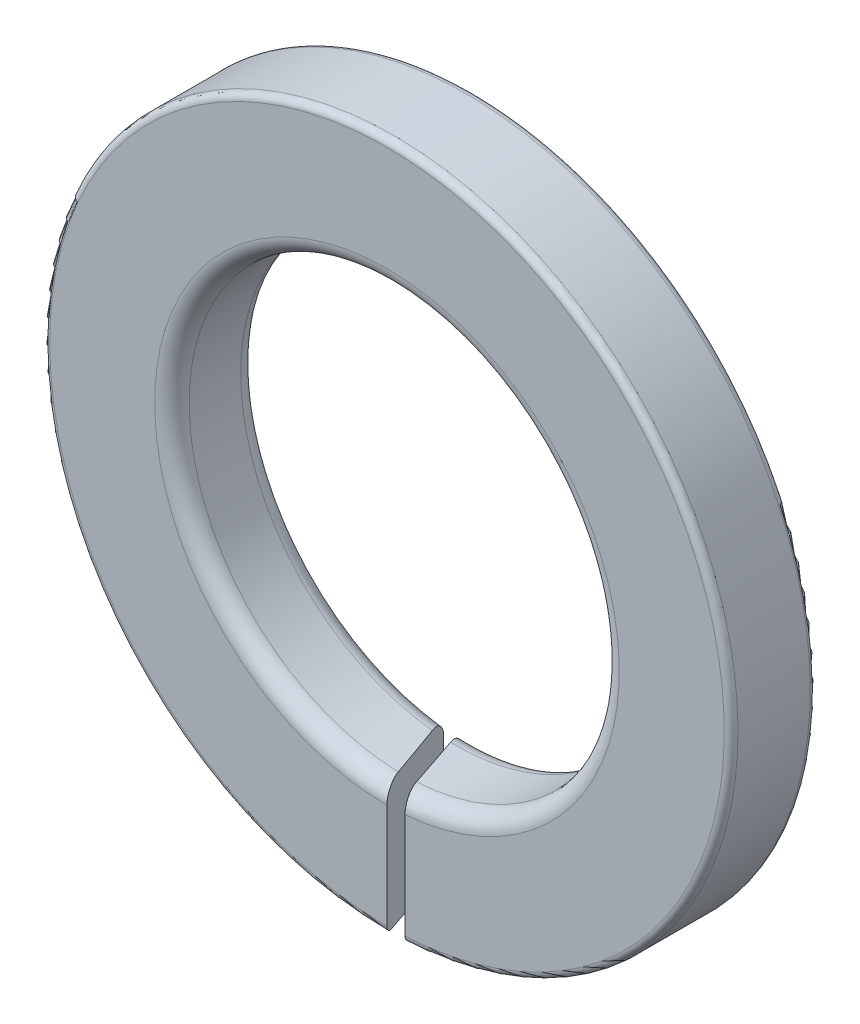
ISO-10303-21;
HEADER;
FILE_DESCRIPTION(('STEP AP214'),'2;1');
FILE_NAME('part.step','',(''),(''),'','','');
FILE_SCHEMA(('AUTOMOTIVE_DESIGN { 1 0 10303 214 1 1 1 1 }'));
ENDSEC;
DATA;
#1=APPLICATION_CONTEXT('core data for automotive mechanical design processes');
#2=APPLICATION_PROTOCOL_DEFINITION('international standard','automotive_design',2000,#1);
#3=PRODUCT_CONTEXT('',#1,'mechanical');
#4=PRODUCT('Part','Part','',(#3));
#5=PRODUCT_RELATED_PRODUCT_CATEGORY('part','',(#4));
#6=PRODUCT_DEFINITION_FORMATION('','',#4);
#7=PRODUCT_DEFINITION_CONTEXT('part definition',#1,'design');
#8=PRODUCT_DEFINITION('design','',#6,#7);
#9=PRODUCT_DEFINITION_SHAPE('','',#8);
#10=(LENGTH_UNIT() NAMED_UNIT(*) SI_UNIT(.MILLI.,.METRE.));
#11=(NAMED_UNIT(*) PLANE_ANGLE_UNIT() SI_UNIT($,.RADIAN.));
#12=(NAMED_UNIT(*) SI_UNIT($,.STERADIAN.) SOLID_ANGLE_UNIT());
#13=UNCERTAINTY_MEASURE_WITH_UNIT(LENGTH_MEASURE(1.E-05),#10,'distance_accuracy_value','');
#14=(GEOMETRIC_REPRESENTATION_CONTEXT(3) GLOBAL_UNCERTAINTY_ASSIGNED_CONTEXT((#13)) GLOBAL_UNIT_ASSIGNED_CONTEXT((#10,
#11,#12)) REPRESENTATION_CONTEXT('',''));
#15=CARTESIAN_POINT('',(0.,0.,0.));
#16=DIRECTION('',(0.,0.,1.));
#17=DIRECTION('',(1.,0.,0.));
#18=AXIS2_PLACEMENT_3D('',#15,#16,#17);
#19=CARTESIAN_POINT('',(0.,0.,2.5));
#20=DIRECTION('',(0.,0.,1.));
#21=DIRECTION('',(1.,0.,0.));
#22=AXIS2_PLACEMENT_3D('',#19,#20,#21);
#23=PLANE('',#22);
#24=DIRECTION('',(0.,1.,0.));
#25=VECTOR('',#24,1.);
#26=CARTESIAN_POINT('',(0.524617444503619,-10.,2.5));
#27=LINE('',#26,#25);
#28=CARTESIAN_POINT('',(0.524617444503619,-9.78594791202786,2.5));
#29=VERTEX_POINT('',#28);
#30=CARTESIAN_POINT('',(0.524617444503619,-6.72958219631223,2.5));
#31=VERTEX_POINT('',#30);
#32=EDGE_CURVE('E107',#29,#31,#27,.T.);
#33=ORIENTED_EDGE('',*,*,#32,.F.);
#34=CARTESIAN_POINT('',(0.,0.,2.5));
#35=DIRECTION('',(0.,0.,1.));
#36=DIRECTION('',(1.,0.,0.));
#37=AXIS2_PLACEMENT_3D('',#34,#35,#36);
#38=CIRCLE('',#37,9.8);
#39=CARTESIAN_POINT('',(0.,-9.8,2.5));
#40=VERTEX_POINT('',#39);
#41=EDGE_CURVE('E166',#29,#40,#38,.T.);
#42=ORIENTED_EDGE('',*,*,#41,.T.);
#43=DIRECTION('',(0.,1.,0.));
#44=VECTOR('',#43,1.);
#45=CARTESIAN_POINT('',(0.,-10.,2.5));
#46=LINE('',#45,#44);
#47=CARTESIAN_POINT('',(0.,-6.75,2.5));
#48=VERTEX_POINT('',#47);
#49=EDGE_CURVE('E198',#40,#48,#46,.T.);
#50=ORIENTED_EDGE('',*,*,#49,.T.);
#51=CARTESIAN_POINT('',(0.,0.,2.5));
#52=DIRECTION('',(0.,0.,1.));
#53=DIRECTION('',(1.,0.,0.));
#54=AXIS2_PLACEMENT_3D('',#51,#52,#53);
#55=CIRCLE('',#54,6.75);
#56=EDGE_CURVE('E196',#48,#31,#55,.F.);
#57=ORIENTED_EDGE('',*,*,#56,.T.);
#58=EDGE_LOOP('',(#33,#42,#50,#57));
#59=FACE_BOUND('',#58,.T.);
#60=ADVANCED_FACE('F36',(#59),#23,.T.);
#61=CARTESIAN_POINT('',(0.,0.,0.));
#62=DIRECTION('',(0.,0.,1.));
#63=DIRECTION('',(1.,0.,0.));
#64=AXIS2_PLACEMENT_3D('',#61,#62,#63);
#65=PLANE('',#64);
#66=DIRECTION('',(0.,1.,0.));
#67=VECTOR('',#66,1.);
#68=CARTESIAN_POINT('',(-0.851663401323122,-10.,0.));
#69=LINE('',#68,#67);
#70=CARTESIAN_POINT('',(-0.851663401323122,-9.76292320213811,0.));
#71=VERTEX_POINT('',#70);
#72=CARTESIAN_POINT('',(-0.851663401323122,-6.69605626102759,0.));
#73=VERTEX_POINT('',#72);
#74=EDGE_CURVE('E226',#71,#73,#69,.T.);
#75=ORIENTED_EDGE('',*,*,#74,.F.);
#76=CARTESIAN_POINT('',(0.,0.,0.));
#77=DIRECTION('',(0.,0.,1.));
#78=DIRECTION('',(1.,0.,0.));
#79=AXIS2_PLACEMENT_3D('',#76,#77,#78);
#80=CIRCLE('',#79,9.8);
#81=CARTESIAN_POINT('',(-0.327045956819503,-9.79454138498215,0.));
#82=VERTEX_POINT('',#81);
#83=EDGE_CURVE('E11',#71,#82,#80,.F.);
#84=ORIENTED_EDGE('',*,*,#83,.T.);
#85=DIRECTION('',(0.,1.,0.));
#86=VECTOR('',#85,1.);
#87=CARTESIAN_POINT('',(-0.327045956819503,-10.,0.));
#88=LINE('',#87,#86);
#89=CARTESIAN_POINT('',(-0.327045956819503,-6.74207245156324,0.));
#90=VERTEX_POINT('',#89);
#91=EDGE_CURVE('E197',#82,#90,#88,.T.);
#92=ORIENTED_EDGE('',*,*,#91,.T.);
#93=CARTESIAN_POINT('',(0.,0.,0.));
#94=DIRECTION('',(0.,0.,1.));
#95=DIRECTION('',(1.,0.,0.));
#96=AXIS2_PLACEMENT_3D('',#93,#94,#95);
#97=CIRCLE('',#96,6.75);
#98=EDGE_CURVE('E112',#90,#73,#97,.T.);
#99=ORIENTED_EDGE('',*,*,#98,.T.);
#100=EDGE_LOOP('',(#75,#84,#92,#99));
#101=FACE_BOUND('',#100,.T.);
#102=ADVANCED_FACE('F218',(#101),#65,.F.);
#103=CARTESIAN_POINT('',(0.,0.,2.5));
#104=DIRECTION('',(0.,0.,-1.));
#105=DIRECTION('',(-1.,0.,0.));
#106=AXIS2_PLACEMENT_3D('',#103,#104,#105);
#107=CYLINDRICAL_SURFACE('',#106,10.);
#108=CARTESIAN_POINT('',(0.,0.,2.5));
#109=DIRECTION('',(-0.946580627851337,0.,0.322467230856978));
#110=DIRECTION('',(-0.322467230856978,0.,-0.946580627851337));
#111=AXIS2_PLACEMENT_3D('',#108,#109,#110);
#112=ELLIPSE('',#111,31.0109029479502,10.);
#113=CARTESIAN_POINT('',(-0.783530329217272,-9.96925675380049,0.2));
#114=VERTEX_POINT('',#113);
#115=CARTESIAN_POINT('',(-0.06813307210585,-9.99976789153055,2.3));
#116=VERTEX_POINT('',#115);
#117=EDGE_CURVE('E234',#114,#116,#112,.T.);
#118=ORIENTED_EDGE('',*,*,#117,.T.);
#119=CARTESIAN_POINT('',(0.,0.,2.3));
#120=DIRECTION('',(0.,0.,1.));
#121=DIRECTION('',(1.,0.,0.));
#122=AXIS2_PLACEMENT_3D('',#119,#120,#121);
#123=CIRCLE('',#122,10.);
#124=CARTESIAN_POINT('',(0.456484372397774,-9.98957566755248,2.30000000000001));
#125=VERTEX_POINT('',#124);
#126=EDGE_CURVE('E184',#116,#125,#123,.F.);
#127=ORIENTED_EDGE('',*,*,#126,.T.);
#128=CARTESIAN_POINT('',(0.,0.,0.960021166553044));
#129=DIRECTION('',(0.946580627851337,0.,-0.322467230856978));
#130=DIRECTION('',(-0.322467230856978,0.,-0.946580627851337));
#131=AXIS2_PLACEMENT_3D('',#128,#129,#130);
#132=ELLIPSE('',#131,31.0109029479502,10.);
#133=CARTESIAN_POINT('',(-0.258912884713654,-9.99664764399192,0.199999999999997));
#134=VERTEX_POINT('',#133);
#135=EDGE_CURVE('E189',#125,#134,#132,.T.);
#136=ORIENTED_EDGE('',*,*,#135,.T.);
#137=CARTESIAN_POINT('',(0.,0.,0.2));
#138=DIRECTION('',(0.,0.,1.));
#139=DIRECTION('',(1.,0.,0.));
#140=AXIS2_PLACEMENT_3D('',#137,#138,#139);
#141=CIRCLE('',#140,10.);
#142=EDGE_CURVE('E231',#134,#114,#141,.T.);
#143=ORIENTED_EDGE('',*,*,#142,.T.);
#144=EDGE_LOOP('',(#118,#127,#136,#143));
#145=FACE_BOUND('',#144,.T.);
#146=ADVANCED_FACE('F38',(#145),#107,.T.);
#147=CARTESIAN_POINT('',(0.,0.,2.5));
#148=DIRECTION('',(0.,0.,-1.));
#149=DIRECTION('',(-1.,0.,0.));
#150=AXIS2_PLACEMENT_3D('',#147,#148,#149);
#151=CYLINDRICAL_SURFACE('',#150,6.25);
#152=CARTESIAN_POINT('',(0.,0.,0.960021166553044));
#153=DIRECTION('',(0.946580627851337,0.,-0.322467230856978));
#154=DIRECTION('',(-0.322467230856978,0.,-0.946580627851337));
#155=AXIS2_PLACEMENT_3D('',#152,#153,#154);
#156=ELLIPSE('',#155,19.3818143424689,6.25);
#157=CARTESIAN_POINT('',(0.354284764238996,-6.2399505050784,2.));
#158=VERTEX_POINT('',#157);
#159=CARTESIAN_POINT('',(-0.156713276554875,-6.24803496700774,0.50000000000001));
#160=VERTEX_POINT('',#159);
#161=EDGE_CURVE('E104',#158,#160,#156,.T.);
#162=ORIENTED_EDGE('',*,*,#161,.F.);
#163=CARTESIAN_POINT('',(0.,0.,2.));
#164=DIRECTION('',(0.,0.,1.));
#165=DIRECTION('',(1.,0.,0.));
#166=AXIS2_PLACEMENT_3D('',#163,#164,#165);
#167=CIRCLE('',#166,6.25);
#168=CARTESIAN_POINT('',(-0.170332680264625,-6.24767851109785,2.));
#169=VERTEX_POINT('',#168);
#170=EDGE_CURVE('E119',#158,#169,#167,.T.);
#171=ORIENTED_EDGE('',*,*,#170,.T.);
#172=CARTESIAN_POINT('',(0.,0.,2.5));
#173=DIRECTION('',(-0.946580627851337,0.,0.322467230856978));
#174=DIRECTION('',(-0.322467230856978,0.,-0.946580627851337));
#175=AXIS2_PLACEMENT_3D('',#172,#173,#174);
#176=ELLIPSE('',#175,19.3818143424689,6.25);
#177=CARTESIAN_POINT('',(-0.681330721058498,-6.21275208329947,0.499999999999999));
#178=VERTEX_POINT('',#177);
#179=EDGE_CURVE('E123',#178,#169,#176,.T.);
#180=ORIENTED_EDGE('',*,*,#179,.F.);
#181=CARTESIAN_POINT('',(0.,0.,0.5));
#182=DIRECTION('',(0.,0.,1.));
#183=DIRECTION('',(1.,0.,0.));
#184=AXIS2_PLACEMENT_3D('',#181,#182,#183);
#185=CIRCLE('',#184,6.25);
#186=EDGE_CURVE('E122',#178,#160,#185,.F.);
#187=ORIENTED_EDGE('',*,*,#186,.T.);
#188=EDGE_LOOP('',(#162,#171,#180,#187));
#189=FACE_BOUND('',#188,.T.);
#190=ADVANCED_FACE('F117',(#189),#151,.F.);
#191=CARTESIAN_POINT('',(-0.851663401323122,-10.,0.));
#192=DIRECTION('',(-0.946580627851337,0.,0.322467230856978));
#193=DIRECTION('',(0.322467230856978,0.,0.946580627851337));
#194=AXIS2_PLACEMENT_3D('',#191,#192,#193);
#195=PLANE('',#194);
#196=ORIENTED_EDGE('',*,*,#49,.F.);
#197=CARTESIAN_POINT('',(0.,-9.8,2.5));
#198=CARTESIAN_POINT('',(3.84756068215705E-06,-9.81081676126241,2.50001129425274));
#199=CARTESIAN_POINT('',(-0.000298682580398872,-9.82162719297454,2.49912323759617));
#200=CARTESIAN_POINT('',(-0.0014867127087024,-9.84291158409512,2.49563585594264));
#201=CARTESIAN_POINT('',(-0.00237090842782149,-9.85338624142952,2.493040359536));
#202=CARTESIAN_POINT('',(-0.00469267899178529,-9.87372589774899,2.4862249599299));
#203=CARTESIAN_POINT('',(-0.00613023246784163,-9.883590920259,2.48200511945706));
#204=CARTESIAN_POINT('',(-0.0095075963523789,-9.90245630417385,2.47209109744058));
#205=CARTESIAN_POINT('',(-0.0114475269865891,-9.91145645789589,2.4663965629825));
#206=CARTESIAN_POINT('',(-0.015815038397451,-9.9285614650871,2.45357603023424));
#207=CARTESIAN_POINT('',(-0.0182524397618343,-9.9366421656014,2.4464212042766));
#208=CARTESIAN_POINT('',(-0.023511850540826,-9.95149300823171,2.4309825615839));
#209=CARTESIAN_POINT('',(-0.0263339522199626,-9.95826283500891,2.42269847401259));
#210=CARTESIAN_POINT('',(-0.0324303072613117,-9.97065407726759,2.40480303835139));
#211=CARTESIAN_POINT('',(-0.035719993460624,-9.97620241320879,2.39514638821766));
#212=CARTESIAN_POINT('',(-0.0425433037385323,-9.98559771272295,2.37511702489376));
#213=CARTESIAN_POINT('',(-0.046076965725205,-9.98944441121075,2.36474420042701));
#214=CARTESIAN_POINT('',(-0.0526929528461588,-9.99487420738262,2.34532342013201));
#215=CARTESIAN_POINT('',(-0.0557526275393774,-9.99672733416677,2.33634195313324));
#216=CARTESIAN_POINT('',(-0.061919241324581,-9.99918490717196,2.31824027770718));
#217=CARTESIAN_POINT('',(-0.0650261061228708,-9.99979114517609,2.30912028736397));
#218=CARTESIAN_POINT('',(-0.0681330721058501,-9.99976789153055,2.3));
#219=B_SPLINE_CURVE_WITH_KNOTS('',3,(#197,#198,#199,#200,#201,#202,#203,#204,#205,#206,#207,
#208,#209,#210,#211,#212,#213,#214,#215,#216,#217,#218),.UNSPECIFIED.,.F.,.F.,(4,2,2,2,2,2,2,2,
2,2,4),(0.,0.032399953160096,0.0647275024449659,0.097053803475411,0.129387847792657,
0.162435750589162,0.195491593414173,0.230177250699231,0.264868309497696,0.293791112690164,
0.322672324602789),.UNSPECIFIED.);
#220=EDGE_CURVE('E165',#40,#116,#219,.T.);
#221=ORIENTED_EDGE('',*,*,#220,.T.);
#222=ORIENTED_EDGE('',*,*,#117,.F.);
#223=CARTESIAN_POINT('',(-0.783530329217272,-9.96925675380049,0.2));
#224=CARTESIAN_POINT('',(-0.78758077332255,-9.96894527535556,0.18811019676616));
#225=CARTESIAN_POINT('',(-0.791621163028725,-9.9675553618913,0.176249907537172));
#226=CARTESIAN_POINT('',(-0.799570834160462,-9.96270462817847,0.152914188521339));
#227=CARTESIAN_POINT('',(-0.803480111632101,-9.95924374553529,0.141438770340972));
#228=CARTESIAN_POINT('',(-0.811057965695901,-9.95033510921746,0.119194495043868));
#229=CARTESIAN_POINT('',(-0.814726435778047,-9.94488648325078,0.108425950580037));
#230=CARTESIAN_POINT('',(-0.821711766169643,-9.93214006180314,0.0879209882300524));
#231=CARTESIAN_POINT('',(-0.825028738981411,-9.9248428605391,0.078184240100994));
#232=CARTESIAN_POINT('',(-0.831174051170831,-9.90866315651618,0.0601450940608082));
#233=CARTESIAN_POINT('',(-0.834007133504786,-9.89979801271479,0.0518287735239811));
#234=CARTESIAN_POINT('',(-0.83912816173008,-9.88065578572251,0.0367963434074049));
#235=CARTESIAN_POINT('',(-0.841416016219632,-9.87037846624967,0.0300805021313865));
#236=CARTESIAN_POINT('',(-0.845269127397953,-9.84917628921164,0.018769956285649));
#237=CARTESIAN_POINT('',(-0.846861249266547,-9.83829834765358,0.0140963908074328));
#238=CARTESIAN_POINT('',(-0.849391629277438,-9.81584371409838,0.00666863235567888));
#239=CARTESIAN_POINT('',(-0.850331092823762,-9.80426835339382,0.00391090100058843));
#240=CARTESIAN_POINT('',(-0.851167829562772,-9.78763740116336,0.00145471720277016));
#241=CARTESIAN_POINT('',(-0.851353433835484,-9.78270881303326,0.000909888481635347));
#242=CARTESIAN_POINT('',(-0.85160110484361,-9.77282880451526,0.000182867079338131));
#243=CARTESIAN_POINT('',(-0.851663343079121,-9.76787742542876,1.70971304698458E-07));
#244=CARTESIAN_POINT('',(-0.851663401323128,-9.76292320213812,0.));
#245=B_SPLINE_CURVE_WITH_KNOTS('',3,(#223,#224,#225,#226,#227,#228,#229,#230,#231,#232,#233,
#234,#235,#236,#237,#238,#239,#240,#241,#242,#243,#244),.UNSPECIFIED.,.F.,.F.,(4,2,2,2,2,2,2,2,
2,2,4),(0.,0.0376434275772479,0.0752879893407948,0.112949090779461,0.150598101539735,
0.187853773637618,0.225115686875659,0.260773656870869,0.296365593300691,0.31123966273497,
0.326093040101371),.UNSPECIFIED.);
#246=EDGE_CURVE('E159',#114,#71,#245,.T.);
#247=ORIENTED_EDGE('',*,*,#246,.T.);
#248=ORIENTED_EDGE('',*,*,#74,.T.);
#249=CARTESIAN_POINT('',(-0.851663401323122,-6.69605626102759,0.));
#250=CARTESIAN_POINT('',(-0.851673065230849,-6.66948466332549,-2.83677439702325E-05));
#251=CARTESIAN_POINT('',(-0.850953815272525,-6.64291064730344,0.00208294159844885));
#252=CARTESIAN_POINT('',(-0.848097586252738,-6.59053101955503,0.0104672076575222));
#253=CARTESIAN_POINT('',(-0.845961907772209,-6.56472472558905,0.0167363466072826));
#254=CARTESIAN_POINT('',(-0.840310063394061,-6.51457807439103,0.0333269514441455));
#255=CARTESIAN_POINT('',(-0.836792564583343,-6.49023915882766,0.0436523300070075));
#256=CARTESIAN_POINT('',(-0.828486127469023,-6.44375769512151,0.0680353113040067));
#257=CARTESIAN_POINT('',(-0.823697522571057,-6.42161457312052,0.0820919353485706));
#258=CARTESIAN_POINT('',(-0.813015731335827,-6.38017613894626,0.113447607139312));
#259=CARTESIAN_POINT('',(-0.80712596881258,-6.360872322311,0.130736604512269));
#260=CARTESIAN_POINT('',(-0.794414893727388,-6.32548649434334,0.168049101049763));
#261=CARTESIAN_POINT('',(-0.787593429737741,-6.30940500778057,0.188073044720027));
#262=CARTESIAN_POINT('',(-0.772978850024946,-6.28030542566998,0.230973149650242));
#263=CARTESIAN_POINT('',(-0.765160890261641,-6.26740759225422,0.25392223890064));
#264=CARTESIAN_POINT('',(-0.748963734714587,-6.24559332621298,0.301467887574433));
#265=CARTESIAN_POINT('',(-0.740584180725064,-6.23667946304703,0.326065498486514));
#266=CARTESIAN_POINT('',(-0.723771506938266,-6.22316080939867,0.37541795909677));
#267=CARTESIAN_POINT('',(-0.715349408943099,-6.21842273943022,0.400140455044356));
#268=CARTESIAN_POINT('',(-0.698386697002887,-6.21274970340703,0.449933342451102));
#269=CARTESIAN_POINT('',(-0.689846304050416,-6.21180841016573,0.475003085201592));
#270=CARTESIAN_POINT('',(-0.681330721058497,-6.21275208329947,0.5));
#271=B_SPLINE_CURVE_WITH_KNOTS('',3,(#249,#250,#251,#252,#253,#254,#255,#256,#257,#258,#259,
#260,#261,#262,#263,#264,#265,#266,#267,#268,#269,#270),.UNSPECIFIED.,.F.,.F.,(4,2,2,2,2,2,2,2,
2,2,4),(0.,0.0796240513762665,0.159175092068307,0.238803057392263,0.318410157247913,
0.397773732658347,0.477150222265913,0.559177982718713,0.641258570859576,0.720613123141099,
0.799835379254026),.UNSPECIFIED.);
#272=EDGE_CURVE('E128',#73,#178,#271,.T.);
#273=ORIENTED_EDGE('',*,*,#272,.T.);
#274=ORIENTED_EDGE('',*,*,#179,.T.);
#275=CARTESIAN_POINT('',(-0.170332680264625,-6.24767851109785,2.));
#276=CARTESIAN_POINT('',(-0.160218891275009,-6.24793898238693,2.02968833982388));
#277=CARTESIAN_POINT('',(-0.150112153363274,-6.25084969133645,2.05935598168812));
#278=CARTESIAN_POINT('',(-0.130183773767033,-6.26183826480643,2.11785438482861));
#279=CARTESIAN_POINT('',(-0.120362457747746,-6.26992180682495,2.14668419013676));
#280=CARTESIAN_POINT('',(-0.101289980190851,-6.29113201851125,2.20267015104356));
#281=CARTESIAN_POINT('',(-0.0920393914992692,-6.30426366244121,2.22982462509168));
#282=CARTESIAN_POINT('',(-0.0744143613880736,-6.33528941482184,2.28156170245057));
#283=CARTESIAN_POINT('',(-0.0660393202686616,-6.3531802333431,2.30614606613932));
#284=CARTESIAN_POINT('',(-0.0506800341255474,-6.3927240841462,2.35123220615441));
#285=CARTESIAN_POINT('',(-0.0436622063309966,-6.41425140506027,2.37183256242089));
#286=CARTESIAN_POINT('',(-0.0309800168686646,-6.46086721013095,2.40906026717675));
#287=CARTESIAN_POINT('',(-0.0253156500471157,-6.48595568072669,2.42568763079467));
#288=CARTESIAN_POINT('',(-0.0158665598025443,-6.53736150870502,2.45342479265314));
#289=CARTESIAN_POINT('',(-0.01199006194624,-6.5635169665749,2.46480398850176));
#290=CARTESIAN_POINT('',(-0.00580110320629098,-6.61753201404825,2.48297125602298));
#291=CARTESIAN_POINT('',(-0.00348622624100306,-6.64538889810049,2.48976641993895));
#292=CARTESIAN_POINT('',(-0.00133323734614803,-6.68626120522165,2.49608637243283));
#293=CARTESIAN_POINT('',(-0.000833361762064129,-6.69896946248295,2.4975537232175));
#294=CARTESIAN_POINT('',(-0.000167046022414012,-6.72444959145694,2.49950964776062));
#295=CARTESIAN_POINT('',(-8.14869889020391E-08,-6.73722133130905,2.49999976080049));
#296=CARTESIAN_POINT('',(0.,-6.75,2.50000000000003));
#297=B_SPLINE_CURVE_WITH_KNOTS('',3,(#275,#276,#277,#278,#279,#280,#281,#282,#283,#284,#285,
#286,#287,#288,#289,#290,#291,#292,#293,#294,#295,#296),.UNSPECIFIED.,.F.,.F.,(4,2,2,2,2,2,2,2,
2,2,4),(0.,0.0939885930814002,0.188080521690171,0.282265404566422,0.376385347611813,
0.467745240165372,0.559104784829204,0.645029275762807,0.730820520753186,0.769192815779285,
0.807504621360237),.UNSPECIFIED.);
#298=EDGE_CURVE('E127',#169,#48,#297,.T.);
#299=ORIENTED_EDGE('',*,*,#298,.T.);
#300=EDGE_LOOP('',(#196,#221,#222,#247,#248,#273,#274,#299));
#301=FACE_BOUND('',#300,.T.);
#302=ADVANCED_FACE('F146',(#301),#195,.F.);
#303=CARTESIAN_POINT('',(0.524617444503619,-10.,2.5));
#304=DIRECTION('',(0.946580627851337,0.,-0.322467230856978));
#305=DIRECTION('',(-0.322467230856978,0.,-0.946580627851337));
#306=AXIS2_PLACEMENT_3D('',#303,#304,#305);
#307=PLANE('',#306);
#308=ORIENTED_EDGE('',*,*,#135,.F.);
#309=CARTESIAN_POINT('',(0.456484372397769,-9.98957566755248,2.3));
#310=CARTESIAN_POINT('',(0.460511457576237,-9.9893987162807,2.31182123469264));
#311=CARTESIAN_POINT('',(0.464532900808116,-9.98815670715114,2.32362590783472));
#312=CARTESIAN_POINT('',(0.472454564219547,-9.98361293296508,2.34687941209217));
#313=CARTESIAN_POINT('',(0.476354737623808,-9.98031038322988,2.35832810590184));
#314=CARTESIAN_POINT('',(0.483923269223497,-9.97171319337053,2.38054501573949));
#315=CARTESIAN_POINT('',(0.487591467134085,-9.96641719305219,2.39131276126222));
#316=CARTESIAN_POINT('',(0.494581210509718,-9.95396071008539,2.41183067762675));
#317=CARTESIAN_POINT('',(0.497902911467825,-9.94680106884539,2.42158130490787));
#318=CARTESIAN_POINT('',(0.504038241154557,-9.93093040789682,2.43959114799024));
#319=CARTESIAN_POINT('',(0.506859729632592,-9.92224866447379,2.44787343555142));
#320=CARTESIAN_POINT('',(0.511965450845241,-9.90347158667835,2.46286093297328));
#321=CARTESIAN_POINT('',(0.514249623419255,-9.89337609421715,2.46956596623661));
#322=CARTESIAN_POINT('',(0.518095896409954,-9.87256787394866,2.48085643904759));
#323=CARTESIAN_POINT('',(0.519686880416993,-9.86190643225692,2.48552666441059));
#324=CARTESIAN_POINT('',(0.522229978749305,-9.8398827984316,2.49299175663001));
#325=CARTESIAN_POINT('',(0.523183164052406,-9.82852181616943,2.49578976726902));
#326=CARTESIAN_POINT('',(0.524068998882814,-9.81186600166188,2.49839007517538));
#327=CARTESIAN_POINT('',(0.524274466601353,-9.80669935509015,2.49899321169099));
#328=CARTESIAN_POINT('',(0.52454857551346,-9.7963387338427,2.4997978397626));
#329=CARTESIAN_POINT('',(0.524617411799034,-9.79114480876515,2.49999990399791));
#330=CARTESIAN_POINT('',(0.524617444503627,-9.78594791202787,2.50000000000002));
#331=B_SPLINE_CURVE_WITH_KNOTS('',3,(#309,#310,#311,#312,#313,#314,#315,#316,#317,#318,#319,
#320,#321,#322,#323,#324,#325,#326,#327,#328,#329,#330),.UNSPECIFIED.,.F.,.F.,(4,2,2,2,2,2,2,2,
2,2,4),(0.,0.0374221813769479,0.0748586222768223,0.112320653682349,0.149765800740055,
0.186557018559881,0.223352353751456,0.258418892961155,0.2934264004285,0.309029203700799,
0.324609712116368),.UNSPECIFIED.);
#332=EDGE_CURVE('E44',#125,#29,#331,.T.);
#333=ORIENTED_EDGE('',*,*,#332,.T.);
#334=ORIENTED_EDGE('',*,*,#32,.T.);
#335=CARTESIAN_POINT('',(0.524617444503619,-6.72958219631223,2.5));
#336=CARTESIAN_POINT('',(0.524627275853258,-6.70290996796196,2.50002885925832));
#337=CARTESIAN_POINT('',(0.523895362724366,-6.67624247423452,2.49788037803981));
#338=CARTESIAN_POINT('',(0.521001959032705,-6.62370529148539,2.48938698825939));
#339=CARTESIAN_POINT('',(0.518842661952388,-6.59783444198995,2.48304851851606));
#340=CARTESIAN_POINT('',(0.513146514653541,-6.54757842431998,2.46632786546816));
#341=CARTESIAN_POINT('',(0.509608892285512,-6.52319409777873,2.45594341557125));
#342=CARTESIAN_POINT('',(0.501273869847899,-6.47659941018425,2.43147652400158));
#343=CARTESIAN_POINT('',(0.496476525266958,-6.45438895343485,2.41739424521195));
#344=CARTESIAN_POINT('',(0.48573454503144,-6.41254263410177,2.38586189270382));
#345=CARTESIAN_POINT('',(0.479781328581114,-6.3929279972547,2.3683866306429));
#346=CARTESIAN_POINT('',(0.466937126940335,-6.35691856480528,2.33068335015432));
#347=CARTESIAN_POINT('',(0.460045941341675,-6.34052445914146,2.31045474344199));
#348=CARTESIAN_POINT('',(0.445205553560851,-6.31062929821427,2.26689179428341));
#349=CARTESIAN_POINT('',(0.437223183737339,-6.29728685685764,2.24346009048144));
#350=CARTESIAN_POINT('',(0.420677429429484,-6.27467215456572,2.19489115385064));
#351=CARTESIAN_POINT('',(0.412113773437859,-6.26540181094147,2.16975312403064));
#352=CARTESIAN_POINT('',(0.395374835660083,-6.2516622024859,2.12061711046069));
#353=CARTESIAN_POINT('',(0.387228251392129,-6.24685231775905,2.09670336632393));
#354=CARTESIAN_POINT('',(0.370812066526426,-6.24076137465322,2.04851477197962));
#355=CARTESIAN_POINT('',(0.362542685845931,-6.23947462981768,2.02424056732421));
#356=CARTESIAN_POINT('',(0.354284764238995,-6.2399505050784,2.));
#357=B_SPLINE_CURVE_WITH_KNOTS('',3,(#335,#336,#337,#338,#339,#340,#341,#342,#343,#344,#345,
#346,#347,#348,#349,#350,#351,#352,#353,#354,#355,#356),.UNSPECIFIED.,.F.,.F.,(4,2,2,2,2,2,2,2,
2,2,4),(0.,0.0799122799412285,0.15970204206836,0.239536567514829,0.319367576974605,
0.399815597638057,0.480280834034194,0.564278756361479,0.648316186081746,0.725223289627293,
0.802006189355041),.UNSPECIFIED.);
#358=EDGE_CURVE('E100',#31,#158,#357,.T.);
#359=ORIENTED_EDGE('',*,*,#358,.T.);
#360=ORIENTED_EDGE('',*,*,#161,.T.);
#361=CARTESIAN_POINT('',(-0.156713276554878,-6.24803496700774,0.5));
#362=CARTESIAN_POINT('',(-0.166704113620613,-6.24776788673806,0.470672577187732));
#363=CARTESIAN_POINT('',(-0.176704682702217,-6.25009024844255,0.441316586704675));
#364=CARTESIAN_POINT('',(-0.196459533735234,-6.25984023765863,0.383327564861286));
#365=CARTESIAN_POINT('',(-0.206213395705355,-6.26727603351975,0.354695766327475));
#366=CARTESIAN_POINT('',(-0.225188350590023,-6.28719333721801,0.298996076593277));
#367=CARTESIAN_POINT('',(-0.234408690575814,-6.29968178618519,0.27193039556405));
#368=CARTESIAN_POINT('',(-0.251997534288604,-6.32946218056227,0.220299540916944));
#369=CARTESIAN_POINT('',(-0.260366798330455,-6.3467497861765,0.195732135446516));
#370=CARTESIAN_POINT('',(-0.275658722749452,-6.38497855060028,0.150843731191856));
#371=CARTESIAN_POINT('',(-0.28262489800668,-6.40575201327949,0.130394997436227));
#372=CARTESIAN_POINT('',(-0.295244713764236,-6.45084817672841,0.0933503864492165));
#373=CARTESIAN_POINT('',(-0.300898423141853,-6.47517069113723,0.0767543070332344));
#374=CARTESIAN_POINT('',(-0.310366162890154,-6.52504725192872,0.0489624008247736));
#375=CARTESIAN_POINT('',(-0.314271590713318,-6.55043488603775,0.0374982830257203));
#376=CARTESIAN_POINT('',(-0.320578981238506,-6.60293313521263,0.0189833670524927));
#377=CARTESIAN_POINT('',(-0.322982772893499,-6.63004160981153,0.0119272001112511));
#378=CARTESIAN_POINT('',(-0.325411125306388,-6.67151470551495,0.0047989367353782));
#379=CARTESIAN_POINT('',(-0.326024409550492,-6.68557040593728,0.00299868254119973));
#380=CARTESIAN_POINT('',(-0.32684154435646,-6.71377260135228,0.000600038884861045));
#381=CARTESIAN_POINT('',(-0.327046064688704,-6.7279189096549,-3.16642705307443E-07));
#382=CARTESIAN_POINT('',(-0.327045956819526,-6.74207245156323,0.));
#383=B_SPLINE_CURVE_WITH_KNOTS('',3,(#361,#362,#363,#364,#365,#366,#367,#368,#369,#370,#371,
#372,#373,#374,#375,#376,#377,#378,#379,#380,#381,#382),.UNSPECIFIED.,.F.,.F.,(4,2,2,2,2,2,2,2,
2,2,4),(0.,0.0928601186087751,0.185868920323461,0.279005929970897,0.372058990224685,
0.461503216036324,0.550942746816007,0.634909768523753,0.718774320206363,0.761275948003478,
0.803707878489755),.UNSPECIFIED.);
#384=EDGE_CURVE('E113',#160,#90,#383,.T.);
#385=ORIENTED_EDGE('',*,*,#384,.T.);
#386=ORIENTED_EDGE('',*,*,#91,.F.);
#387=CARTESIAN_POINT('',(-0.327045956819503,-9.79454138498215,0.));
#388=CARTESIAN_POINT('',(-0.327049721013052,-9.8054549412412,-1.10495341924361E-05));
#389=CARTESIAN_POINT('',(-0.326742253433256,-9.81636031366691,0.000891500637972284));
#390=CARTESIAN_POINT('',(-0.325538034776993,-9.83782684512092,0.00442640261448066));
#391=CARTESIAN_POINT('',(-0.324642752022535,-9.84838879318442,0.00705444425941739));
#392=CARTESIAN_POINT('',(-0.3222961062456,-9.86889511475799,0.0139428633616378));
#393=CARTESIAN_POINT('',(-0.320844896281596,-9.87883965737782,0.0182027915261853));
#394=CARTESIAN_POINT('',(-0.317439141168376,-9.8978631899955,0.0282001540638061));
#395=CARTESIAN_POINT('',(-0.315484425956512,-9.90694188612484,0.0339380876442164));
#396=CARTESIAN_POINT('',(-0.311073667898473,-9.92425715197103,0.0468855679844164));
#397=CARTESIAN_POINT('',(-0.308605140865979,-9.93246309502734,0.054131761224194));
#398=CARTESIAN_POINT('',(-0.303278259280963,-9.9475512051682,0.0697684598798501));
#399=CARTESIAN_POINT('',(-0.300419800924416,-9.95443301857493,0.0781592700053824));
#400=CARTESIAN_POINT('',(-0.29423658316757,-9.96705117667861,0.0963096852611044));
#401=CARTESIAN_POINT('',(-0.290895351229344,-9.9727098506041,0.106117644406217));
#402=CARTESIAN_POINT('',(-0.283963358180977,-9.98229087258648,0.126466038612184));
#403=CARTESIAN_POINT('',(-0.280372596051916,-9.98621321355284,0.137006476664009));
#404=CARTESIAN_POINT('',(-0.27380330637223,-9.99161434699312,0.156290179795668));
#405=CARTESIAN_POINT('',(-0.270853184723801,-9.99343206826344,0.164950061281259));
#406=CARTESIAN_POINT('',(-0.264907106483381,-9.99590983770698,0.18240436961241));
#407=CARTESIAN_POINT('',(-0.261911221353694,-9.99657153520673,0.191198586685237));
#408=CARTESIAN_POINT('',(-0.258912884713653,-9.99664764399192,0.2));
#409=B_SPLINE_CURVE_WITH_KNOTS('',3,(#387,#388,#389,#390,#391,#392,#393,#394,#395,#396,#397,
#398,#399,#400,#401,#402,#403,#404,#405,#406,#407,#408),.UNSPECIFIED.,.F.,.F.,(4,2,2,2,2,2,2,2,
2,2,4),(0.,0.0326866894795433,0.0652920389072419,0.0978884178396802,0.130495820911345,
0.164014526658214,0.197542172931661,0.232804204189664,0.268066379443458,0.295978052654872,
0.323849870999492),.UNSPECIFIED.);
#410=EDGE_CURVE('E56',#82,#134,#409,.T.);
#411=ORIENTED_EDGE('',*,*,#410,.T.);
#412=EDGE_LOOP('',(#308,#333,#334,#359,#360,#385,#386,#411));
#413=FACE_BOUND('',#412,.T.);
#414=ADVANCED_FACE('F102',(#413),#307,.F.);
#415=CARTESIAN_POINT('',(0.,0.,2.));
#416=DIRECTION('',(0.,0.,1.));
#417=DIRECTION('',(1.,0.,0.));
#418=AXIS2_PLACEMENT_3D('',#415,#416,#417);
#419=TOROIDAL_SURFACE('',#418,6.75,0.5);
#420=ORIENTED_EDGE('',*,*,#358,.F.);
#421=ORIENTED_EDGE('',*,*,#56,.F.);
#422=ORIENTED_EDGE('',*,*,#298,.F.);
#423=ORIENTED_EDGE('',*,*,#170,.F.);
#424=EDGE_LOOP('',(#420,#421,#422,#423));
#425=FACE_BOUND('',#424,.T.);
#426=ADVANCED_FACE('F125',(#425),#419,.T.);
#427=CARTESIAN_POINT('',(0.,0.,0.5));
#428=DIRECTION('',(0.,0.,1.));
#429=DIRECTION('',(1.,0.,0.));
#430=AXIS2_PLACEMENT_3D('',#427,#428,#429);
#431=TOROIDAL_SURFACE('',#430,6.75,0.5);
#432=ORIENTED_EDGE('',*,*,#384,.F.);
#433=ORIENTED_EDGE('',*,*,#186,.F.);
#434=ORIENTED_EDGE('',*,*,#272,.F.);
#435=ORIENTED_EDGE('',*,*,#98,.F.);
#436=EDGE_LOOP('',(#432,#433,#434,#435));
#437=FACE_BOUND('',#436,.T.);
#438=ADVANCED_FACE('F143',(#437),#431,.T.);
#439=CARTESIAN_POINT('',(0.,0.,2.3));
#440=DIRECTION('',(0.,0.,1.));
#441=DIRECTION('',(1.,0.,0.));
#442=AXIS2_PLACEMENT_3D('',#439,#440,#441);
#443=TOROIDAL_SURFACE('',#442,9.8,0.2);
#444=ORIENTED_EDGE('',*,*,#332,.F.);
#445=ORIENTED_EDGE('',*,*,#126,.F.);
#446=ORIENTED_EDGE('',*,*,#220,.F.);
#447=ORIENTED_EDGE('',*,*,#41,.F.);
#448=EDGE_LOOP('',(#444,#445,#446,#447));
#449=FACE_BOUND('',#448,.T.);
#450=ADVANCED_FACE('F175',(#449),#443,.T.);
#451=CARTESIAN_POINT('',(0.,0.,0.2));
#452=DIRECTION('',(0.,0.,1.));
#453=DIRECTION('',(1.,0.,0.));
#454=AXIS2_PLACEMENT_3D('',#451,#452,#453);
#455=TOROIDAL_SURFACE('',#454,9.8,0.2);
#456=ORIENTED_EDGE('',*,*,#410,.F.);
#457=ORIENTED_EDGE('',*,*,#83,.F.);
#458=ORIENTED_EDGE('',*,*,#246,.F.);
#459=ORIENTED_EDGE('',*,*,#142,.F.);
#460=EDGE_LOOP('',(#456,#457,#458,#459));
#461=FACE_BOUND('',#460,.T.);
#462=ADVANCED_FACE('F172',(#461),#455,.T.);
#463=CLOSED_SHELL('',(#60,#102,#146,#190,#302,#414,#426,#438,#450,#462));
#464=MANIFOLD_SOLID_BREP('B2',#463);
#465=ADVANCED_BREP_SHAPE_REPRESENTATION('',(#18,#464),#14);
#466=SHAPE_DEFINITION_REPRESENTATION(#9,#465);
ENDSEC;
END-ISO-10303-21;
